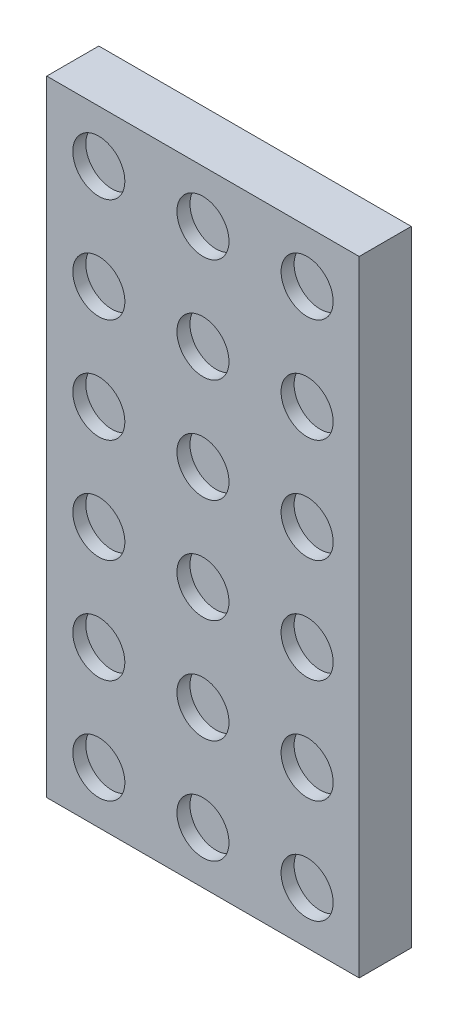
ISO-10303-21;
HEADER;
FILE_DESCRIPTION(('STEP AP214'),'2;1');
FILE_NAME('part.step','',(''),(''),'','','');
FILE_SCHEMA(('AUTOMOTIVE_DESIGN { 1 0 10303 214 1 1 1 1 }'));
ENDSEC;
DATA;
#1=APPLICATION_CONTEXT('core data for automotive mechanical design processes');
#2=APPLICATION_PROTOCOL_DEFINITION('international standard','automotive_design',2000,#1);
#3=PRODUCT_CONTEXT('',#1,'mechanical');
#4=PRODUCT('Part','Part','',(#3));
#5=PRODUCT_RELATED_PRODUCT_CATEGORY('part','',(#4));
#6=PRODUCT_DEFINITION_FORMATION('','',#4);
#7=PRODUCT_DEFINITION_CONTEXT('part definition',#1,'design');
#8=PRODUCT_DEFINITION('design','',#6,#7);
#9=PRODUCT_DEFINITION_SHAPE('','',#8);
#10=(LENGTH_UNIT() NAMED_UNIT(*) SI_UNIT(.MILLI.,.METRE.));
#11=(NAMED_UNIT(*) PLANE_ANGLE_UNIT() SI_UNIT($,.RADIAN.));
#12=(NAMED_UNIT(*) SI_UNIT($,.STERADIAN.) SOLID_ANGLE_UNIT());
#13=UNCERTAINTY_MEASURE_WITH_UNIT(LENGTH_MEASURE(1.E-05),#10,'distance_accuracy_value','');
#14=(GEOMETRIC_REPRESENTATION_CONTEXT(3) GLOBAL_UNCERTAINTY_ASSIGNED_CONTEXT((#13)) GLOBAL_UNIT_ASSIGNED_CONTEXT((#10,
#11,#12)) REPRESENTATION_CONTEXT('',''));
#15=CARTESIAN_POINT('',(0.,0.,0.));
#16=DIRECTION('',(0.,0.,1.));
#17=DIRECTION('',(1.,0.,0.));
#18=AXIS2_PLACEMENT_3D('',#15,#16,#17);
#19=CARTESIAN_POINT('',(0.,0.,12.7));
#20=DIRECTION('',(0.,0.,-1.));
#21=DIRECTION('',(-1.,0.,0.));
#22=AXIS2_PLACEMENT_3D('',#19,#20,#21);
#23=PLANE('',#22);
#24=CARTESIAN_POINT('',(63.5,88.9,12.7));
#25=DIRECTION('',(0.,0.,1.));
#26=DIRECTION('',(1.,0.,0.));
#27=AXIS2_PLACEMENT_3D('',#24,#25,#26);
#28=CIRCLE('',#27,6.34999999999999);
#29=CARTESIAN_POINT('',(69.85,88.9,12.7));
#30=VERTEX_POINT('',#29);
#31=EDGE_CURVE('E239',#30,#30,#28,.T.);
#32=ORIENTED_EDGE('',*,*,#31,.F.);
#33=EDGE_LOOP('',(#32));
#34=FACE_BOUND('',#33,.T.);
#35=CARTESIAN_POINT('',(38.1,88.9,12.7));
#36=DIRECTION('',(0.,0.,1.));
#37=DIRECTION('',(1.,0.,0.));
#38=AXIS2_PLACEMENT_3D('',#35,#36,#37);
#39=CIRCLE('',#38,6.35);
#40=CARTESIAN_POINT('',(44.45,88.9,12.7));
#41=VERTEX_POINT('',#40);
#42=EDGE_CURVE('E230',#41,#41,#39,.T.);
#43=ORIENTED_EDGE('',*,*,#42,.F.);
#44=EDGE_LOOP('',(#43));
#45=FACE_BOUND('',#44,.T.);
#46=CARTESIAN_POINT('',(12.7,38.1,12.7));
#47=DIRECTION('',(0.,0.,1.));
#48=DIRECTION('',(1.,0.,0.));
#49=AXIS2_PLACEMENT_3D('',#46,#47,#48);
#50=CIRCLE('',#49,6.35);
#51=CARTESIAN_POINT('',(19.05,38.1,12.7));
#52=VERTEX_POINT('',#51);
#53=EDGE_CURVE('E198',#52,#52,#50,.T.);
#54=ORIENTED_EDGE('',*,*,#53,.F.);
#55=EDGE_LOOP('',(#54));
#56=FACE_BOUND('',#55,.T.);
#57=CARTESIAN_POINT('',(38.1,139.7,12.7));
#58=DIRECTION('',(0.,0.,1.));
#59=DIRECTION('',(1.,0.,0.));
#60=AXIS2_PLACEMENT_3D('',#57,#58,#59);
#61=CIRCLE('',#60,6.35);
#62=CARTESIAN_POINT('',(44.45,139.7,12.7));
#63=VERTEX_POINT('',#62);
#64=EDGE_CURVE('E278',#63,#63,#61,.T.);
#65=ORIENTED_EDGE('',*,*,#64,.F.);
#66=EDGE_LOOP('',(#65));
#67=FACE_BOUND('',#66,.T.);
#68=CARTESIAN_POINT('',(63.5,139.7,12.7));
#69=DIRECTION('',(0.,0.,1.));
#70=DIRECTION('',(1.,0.,0.));
#71=AXIS2_PLACEMENT_3D('',#68,#69,#70);
#72=CIRCLE('',#71,6.34999999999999);
#73=CARTESIAN_POINT('',(69.85,139.7,12.7));
#74=VERTEX_POINT('',#73);
#75=EDGE_CURVE('E287',#74,#74,#72,.T.);
#76=ORIENTED_EDGE('',*,*,#75,.F.);
#77=EDGE_LOOP('',(#76));
#78=FACE_BOUND('',#77,.T.);
#79=CARTESIAN_POINT('',(12.7,88.9,12.7));
#80=DIRECTION('',(0.,0.,1.));
#81=DIRECTION('',(1.,0.,0.));
#82=AXIS2_PLACEMENT_3D('',#79,#80,#81);
#83=CIRCLE('',#82,6.35);
#84=CARTESIAN_POINT('',(19.05,88.9,12.7));
#85=VERTEX_POINT('',#84);
#86=EDGE_CURVE('E271',#85,#85,#83,.T.);
#87=ORIENTED_EDGE('',*,*,#86,.F.);
#88=EDGE_LOOP('',(#87));
#89=FACE_BOUND('',#88,.T.);
#90=CARTESIAN_POINT('',(38.1,38.1,12.7));
#91=DIRECTION('',(0.,0.,1.));
#92=DIRECTION('',(1.,0.,0.));
#93=AXIS2_PLACEMENT_3D('',#90,#91,#92);
#94=CIRCLE('',#93,6.35);
#95=CARTESIAN_POINT('',(44.45,38.1,12.7));
#96=VERTEX_POINT('',#95);
#97=EDGE_CURVE('E182',#96,#96,#94,.T.);
#98=ORIENTED_EDGE('',*,*,#97,.F.);
#99=EDGE_LOOP('',(#98));
#100=FACE_BOUND('',#99,.T.);
#101=CARTESIAN_POINT('',(63.5,38.1,12.7));
#102=DIRECTION('',(0.,0.,1.));
#103=DIRECTION('',(1.,0.,0.));
#104=AXIS2_PLACEMENT_3D('',#101,#102,#103);
#105=CIRCLE('',#104,6.35);
#106=CARTESIAN_POINT('',(69.85,38.1,12.7));
#107=VERTEX_POINT('',#106);
#108=EDGE_CURVE('E191',#107,#107,#105,.T.);
#109=ORIENTED_EDGE('',*,*,#108,.F.);
#110=EDGE_LOOP('',(#109));
#111=FACE_BOUND('',#110,.T.);
#112=CARTESIAN_POINT('',(12.7,139.7,12.7));
#113=DIRECTION('',(0.,0.,1.));
#114=DIRECTION('',(1.,0.,0.));
#115=AXIS2_PLACEMENT_3D('',#112,#113,#114);
#116=CIRCLE('',#115,6.35);
#117=CARTESIAN_POINT('',(19.05,139.7,12.7));
#118=VERTEX_POINT('',#117);
#119=EDGE_CURVE('E282',#118,#118,#116,.T.);
#120=ORIENTED_EDGE('',*,*,#119,.F.);
#121=EDGE_LOOP('',(#120));
#122=FACE_BOUND('',#121,.T.);
#123=DIRECTION('',(0.,-1.,0.));
#124=VECTOR('',#123,1.);
#125=CARTESIAN_POINT('',(0.,0.,12.7));
#126=LINE('',#125,#124);
#127=CARTESIAN_POINT('',(0.,152.4,12.7));
#128=VERTEX_POINT('',#127);
#129=CARTESIAN_POINT('',(0.,0.,12.7));
#130=VERTEX_POINT('',#129);
#131=EDGE_CURVE('E302',#128,#130,#126,.T.);
#132=ORIENTED_EDGE('',*,*,#131,.T.);
#133=DIRECTION('',(1.,0.,0.));
#134=VECTOR('',#133,1.);
#135=CARTESIAN_POINT('',(0.,0.,12.7));
#136=LINE('',#135,#134);
#137=CARTESIAN_POINT('',(76.2,0.,12.7));
#138=VERTEX_POINT('',#137);
#139=EDGE_CURVE('E98',#130,#138,#136,.T.);
#140=ORIENTED_EDGE('',*,*,#139,.T.);
#141=DIRECTION('',(0.,1.,0.));
#142=VECTOR('',#141,1.);
#143=CARTESIAN_POINT('',(76.2,0.,12.7));
#144=LINE('',#143,#142);
#145=CARTESIAN_POINT('',(76.2,152.4,12.7));
#146=VERTEX_POINT('',#145);
#147=EDGE_CURVE('E307',#138,#146,#144,.T.);
#148=ORIENTED_EDGE('',*,*,#147,.T.);
#149=DIRECTION('',(-1.,0.,0.));
#150=VECTOR('',#149,1.);
#151=CARTESIAN_POINT('',(0.,152.4,12.7));
#152=LINE('',#151,#150);
#153=EDGE_CURVE('E70',#146,#128,#152,.T.);
#154=ORIENTED_EDGE('',*,*,#153,.T.);
#155=EDGE_LOOP('',(#132,#140,#148,#154));
#156=FACE_BOUND('',#155,.T.);
#157=CARTESIAN_POINT('',(12.7,12.7,12.7));
#158=DIRECTION('',(0.,0.,-1.));
#159=DIRECTION('',(-1.,0.,0.));
#160=AXIS2_PLACEMENT_3D('',#157,#158,#159);
#161=CIRCLE('',#160,6.35);
#162=CARTESIAN_POINT('',(6.35,12.7,12.7));
#163=VERTEX_POINT('',#162);
#164=EDGE_CURVE('E174',#163,#163,#161,.T.);
#165=ORIENTED_EDGE('',*,*,#164,.T.);
#166=EDGE_LOOP('',(#165));
#167=FACE_BOUND('',#166,.T.);
#168=CARTESIAN_POINT('',(38.1,12.7,12.7));
#169=DIRECTION('',(0.,0.,-1.));
#170=DIRECTION('',(-1.,0.,0.));
#171=AXIS2_PLACEMENT_3D('',#168,#169,#170);
#172=CIRCLE('',#171,6.35);
#173=CARTESIAN_POINT('',(31.75,12.7,12.7));
#174=VERTEX_POINT('',#173);
#175=EDGE_CURVE('E158',#174,#174,#172,.T.);
#176=ORIENTED_EDGE('',*,*,#175,.T.);
#177=EDGE_LOOP('',(#176));
#178=FACE_BOUND('',#177,.T.);
#179=CARTESIAN_POINT('',(63.5,12.7,12.7));
#180=DIRECTION('',(0.,0.,-1.));
#181=DIRECTION('',(-1.,0.,0.));
#182=AXIS2_PLACEMENT_3D('',#179,#180,#181);
#183=CIRCLE('',#182,6.35);
#184=CARTESIAN_POINT('',(57.15,12.7,12.7));
#185=VERTEX_POINT('',#184);
#186=EDGE_CURVE('E167',#185,#185,#183,.T.);
#187=ORIENTED_EDGE('',*,*,#186,.T.);
#188=EDGE_LOOP('',(#187));
#189=FACE_BOUND('',#188,.T.);
#190=CARTESIAN_POINT('',(12.7,114.3,12.7));
#191=DIRECTION('',(0.,0.,-1.));
#192=DIRECTION('',(-1.,0.,0.));
#193=AXIS2_PLACEMENT_3D('',#190,#191,#192);
#194=CIRCLE('',#193,6.35);
#195=CARTESIAN_POINT('',(6.35,114.3,12.7));
#196=VERTEX_POINT('',#195);
#197=EDGE_CURVE('E263',#196,#196,#194,.T.);
#198=ORIENTED_EDGE('',*,*,#197,.T.);
#199=EDGE_LOOP('',(#198));
#200=FACE_BOUND('',#199,.T.);
#201=CARTESIAN_POINT('',(38.1,114.3,12.7));
#202=DIRECTION('',(0.,0.,-1.));
#203=DIRECTION('',(-1.,0.,0.));
#204=AXIS2_PLACEMENT_3D('',#201,#202,#203);
#205=CIRCLE('',#204,6.35);
#206=CARTESIAN_POINT('',(31.75,114.3,12.7));
#207=VERTEX_POINT('',#206);
#208=EDGE_CURVE('E255',#207,#207,#205,.T.);
#209=ORIENTED_EDGE('',*,*,#208,.T.);
#210=EDGE_LOOP('',(#209));
#211=FACE_BOUND('',#210,.T.);
#212=CARTESIAN_POINT('',(63.5,114.3,12.7));
#213=DIRECTION('',(0.,0.,-1.));
#214=DIRECTION('',(-1.,0.,0.));
#215=AXIS2_PLACEMENT_3D('',#212,#213,#214);
#216=CIRCLE('',#215,6.34999999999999);
#217=CARTESIAN_POINT('',(57.15,114.3,12.7));
#218=VERTEX_POINT('',#217);
#219=EDGE_CURVE('E246',#218,#218,#216,.T.);
#220=ORIENTED_EDGE('',*,*,#219,.T.);
#221=EDGE_LOOP('',(#220));
#222=FACE_BOUND('',#221,.T.);
#223=CARTESIAN_POINT('',(38.1,63.5,12.7));
#224=DIRECTION('',(0.,0.,-1.));
#225=DIRECTION('',(-1.,0.,0.));
#226=AXIS2_PLACEMENT_3D('',#223,#224,#225);
#227=CIRCLE('',#226,6.35);
#228=CARTESIAN_POINT('',(31.75,63.5,12.7));
#229=VERTEX_POINT('',#228);
#230=EDGE_CURVE('E206',#229,#229,#227,.T.);
#231=ORIENTED_EDGE('',*,*,#230,.T.);
#232=EDGE_LOOP('',(#231));
#233=FACE_BOUND('',#232,.T.);
#234=CARTESIAN_POINT('',(63.5,63.5,12.7));
#235=DIRECTION('',(0.,0.,-1.));
#236=DIRECTION('',(-1.,0.,0.));
#237=AXIS2_PLACEMENT_3D('',#234,#235,#236);
#238=CIRCLE('',#237,6.34999999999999);
#239=CARTESIAN_POINT('',(57.15,63.5,12.7));
#240=VERTEX_POINT('',#239);
#241=EDGE_CURVE('E215',#240,#240,#238,.T.);
#242=ORIENTED_EDGE('',*,*,#241,.T.);
#243=EDGE_LOOP('',(#242));
#244=FACE_BOUND('',#243,.T.);
#245=CARTESIAN_POINT('',(12.7,63.5,12.7));
#246=DIRECTION('',(0.,0.,-1.));
#247=DIRECTION('',(-1.,0.,0.));
#248=AXIS2_PLACEMENT_3D('',#245,#246,#247);
#249=CIRCLE('',#248,6.35);
#250=CARTESIAN_POINT('',(6.35,63.5,12.7));
#251=VERTEX_POINT('',#250);
#252=EDGE_CURVE('E222',#251,#251,#249,.T.);
#253=ORIENTED_EDGE('',*,*,#252,.T.);
#254=EDGE_LOOP('',(#253));
#255=FACE_BOUND('',#254,.T.);
#256=ADVANCED_FACE('F45',(#34,#45,#56,#67,#78,#89,#100,#111,#122,#156,#167,#178,#189,#200,#211,
#222,#233,#244,#255),#23,.F.);
#257=CARTESIAN_POINT('',(0.,0.,12.7));
#258=DIRECTION('',(1.,0.,0.));
#259=DIRECTION('',(0.,0.,-1.));
#260=AXIS2_PLACEMENT_3D('',#257,#258,#259);
#261=PLANE('',#260);
#262=DIRECTION('',(0.,-1.,0.));
#263=VECTOR('',#262,1.);
#264=CARTESIAN_POINT('',(0.,0.,0.));
#265=LINE('',#264,#263);
#266=CARTESIAN_POINT('',(0.,152.4,0.));
#267=VERTEX_POINT('',#266);
#268=CARTESIAN_POINT('',(0.,0.,0.));
#269=VERTEX_POINT('',#268);
#270=EDGE_CURVE('E298',#267,#269,#265,.T.);
#271=ORIENTED_EDGE('',*,*,#270,.T.);
#272=DIRECTION('',(0.,0.,-1.));
#273=VECTOR('',#272,1.);
#274=CARTESIAN_POINT('',(0.,0.,12.7));
#275=LINE('',#274,#273);
#276=EDGE_CURVE('E11',#130,#269,#275,.T.);
#277=ORIENTED_EDGE('',*,*,#276,.F.);
#278=ORIENTED_EDGE('',*,*,#131,.F.);
#279=DIRECTION('',(0.,0.,-1.));
#280=VECTOR('',#279,1.);
#281=CARTESIAN_POINT('',(0.,152.4,12.7));
#282=LINE('',#281,#280);
#283=EDGE_CURVE('E312',#128,#267,#282,.T.);
#284=ORIENTED_EDGE('',*,*,#283,.T.);
#285=EDGE_LOOP('',(#271,#277,#278,#284));
#286=FACE_BOUND('',#285,.T.);
#287=ADVANCED_FACE('F47',(#286),#261,.F.);
#288=CARTESIAN_POINT('',(0.,0.,12.7));
#289=DIRECTION('',(0.,1.,0.));
#290=DIRECTION('',(0.,0.,1.));
#291=AXIS2_PLACEMENT_3D('',#288,#289,#290);
#292=PLANE('',#291);
#293=DIRECTION('',(-1.,0.,0.));
#294=VECTOR('',#293,1.);
#295=CARTESIAN_POINT('',(36.83,0.,8.89));
#296=LINE('',#295,#294);
#297=CARTESIAN_POINT('',(39.37,0.,8.89));
#298=VERTEX_POINT('',#297);
#299=CARTESIAN_POINT('',(36.83,0.,8.89));
#300=VERTEX_POINT('',#299);
#301=EDGE_CURVE('E128',#298,#300,#296,.T.);
#302=ORIENTED_EDGE('',*,*,#301,.F.);
#303=DIRECTION('',(0.,0.,-1.));
#304=VECTOR('',#303,1.);
#305=CARTESIAN_POINT('',(39.37,0.,8.89));
#306=LINE('',#305,#304);
#307=CARTESIAN_POINT('',(39.37,0.,0.));
#308=VERTEX_POINT('',#307);
#309=EDGE_CURVE('E157',#298,#308,#306,.T.);
#310=ORIENTED_EDGE('',*,*,#309,.T.);
#311=DIRECTION('',(1.,0.,0.));
#312=VECTOR('',#311,1.);
#313=CARTESIAN_POINT('',(0.,0.,0.));
#314=LINE('',#313,#312);
#315=CARTESIAN_POINT('',(76.2,0.,0.));
#316=VERTEX_POINT('',#315);
#317=EDGE_CURVE('E316',#308,#316,#314,.T.);
#318=ORIENTED_EDGE('',*,*,#317,.T.);
#319=DIRECTION('',(0.,0.,-1.));
#320=VECTOR('',#319,1.);
#321=CARTESIAN_POINT('',(76.2,0.,12.7));
#322=LINE('',#321,#320);
#323=EDGE_CURVE('E54',#138,#316,#322,.T.);
#324=ORIENTED_EDGE('',*,*,#323,.F.);
#325=ORIENTED_EDGE('',*,*,#139,.F.);
#326=ORIENTED_EDGE('',*,*,#276,.T.);
#327=CARTESIAN_POINT('',(36.83,0.,0.));
#328=VERTEX_POINT('',#327);
#329=EDGE_CURVE('E139',#269,#328,#314,.T.);
#330=ORIENTED_EDGE('',*,*,#329,.T.);
#331=DIRECTION('',(0.,0.,-1.));
#332=VECTOR('',#331,1.);
#333=CARTESIAN_POINT('',(36.83,0.,8.89));
#334=LINE('',#333,#332);
#335=EDGE_CURVE('E121',#300,#328,#334,.T.);
#336=ORIENTED_EDGE('',*,*,#335,.F.);
#337=EDGE_LOOP('',(#302,#310,#318,#324,#325,#326,#330,#336));
#338=FACE_BOUND('',#337,.T.);
#339=ADVANCED_FACE('F138',(#338),#292,.F.);
#340=CARTESIAN_POINT('',(76.2,0.,12.7));
#341=DIRECTION('',(-1.,0.,0.));
#342=DIRECTION('',(0.,0.,1.));
#343=AXIS2_PLACEMENT_3D('',#340,#341,#342);
#344=PLANE('',#343);
#345=DIRECTION('',(0.,1.,0.));
#346=VECTOR('',#345,1.);
#347=CARTESIAN_POINT('',(76.2,0.,0.));
#348=LINE('',#347,#346);
#349=CARTESIAN_POINT('',(76.2,152.4,0.));
#350=VERTEX_POINT('',#349);
#351=EDGE_CURVE('E319',#316,#350,#348,.T.);
#352=ORIENTED_EDGE('',*,*,#351,.T.);
#353=DIRECTION('',(0.,0.,-1.));
#354=VECTOR('',#353,1.);
#355=CARTESIAN_POINT('',(76.2,152.4,12.7));
#356=LINE('',#355,#354);
#357=EDGE_CURVE('E326',#146,#350,#356,.T.);
#358=ORIENTED_EDGE('',*,*,#357,.F.);
#359=ORIENTED_EDGE('',*,*,#147,.F.);
#360=ORIENTED_EDGE('',*,*,#323,.T.);
#361=EDGE_LOOP('',(#352,#358,#359,#360));
#362=FACE_BOUND('',#361,.T.);
#363=ADVANCED_FACE('F333',(#362),#344,.F.);
#364=CARTESIAN_POINT('',(0.,152.4,12.7));
#365=DIRECTION('',(0.,-1.,0.));
#366=DIRECTION('',(0.,0.,-1.));
#367=AXIS2_PLACEMENT_3D('',#364,#365,#366);
#368=PLANE('',#367);
#369=DIRECTION('',(-1.,0.,0.));
#370=VECTOR('',#369,1.);
#371=CARTESIAN_POINT('',(0.,152.4,0.));
#372=LINE('',#371,#370);
#373=EDGE_CURVE('E91',#350,#267,#372,.T.);
#374=ORIENTED_EDGE('',*,*,#373,.T.);
#375=ORIENTED_EDGE('',*,*,#283,.F.);
#376=ORIENTED_EDGE('',*,*,#153,.F.);
#377=ORIENTED_EDGE('',*,*,#357,.T.);
#378=EDGE_LOOP('',(#374,#375,#376,#377));
#379=FACE_BOUND('',#378,.T.);
#380=ADVANCED_FACE('F343',(#379),#368,.F.);
#381=CARTESIAN_POINT('',(0.,0.,0.));
#382=DIRECTION('',(0.,0.,-1.));
#383=DIRECTION('',(-1.,0.,0.));
#384=AXIS2_PLACEMENT_3D('',#381,#382,#383);
#385=PLANE('',#384);
#386=DIRECTION('',(0.,-1.,0.));
#387=VECTOR('',#386,1.);
#388=CARTESIAN_POINT('',(39.37,0.,0.));
#389=LINE('',#388,#387);
#390=CARTESIAN_POINT('',(39.37,44.4754101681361,0.));
#391=VERTEX_POINT('',#390);
#392=EDGE_CURVE('E135',#391,#308,#389,.T.);
#393=ORIENTED_EDGE('',*,*,#392,.F.);
#394=CARTESIAN_POINT('',(38.1,76.2,0.));
#395=DIRECTION('',(0.,0.,-1.));
#396=DIRECTION('',(-1.,0.,0.));
#397=AXIS2_PLACEMENT_3D('',#394,#395,#396);
#398=CIRCLE('',#397,31.75);
#399=CARTESIAN_POINT('',(36.83,44.4754101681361,0.));
#400=VERTEX_POINT('',#399);
#401=EDGE_CURVE('E153',#400,#391,#398,.T.);
#402=ORIENTED_EDGE('',*,*,#401,.F.);
#403=DIRECTION('',(0.,1.,0.));
#404=VECTOR('',#403,1.);
#405=CARTESIAN_POINT('',(36.83,0.,0.));
#406=LINE('',#405,#404);
#407=EDGE_CURVE('E521',#328,#400,#406,.T.);
#408=ORIENTED_EDGE('',*,*,#407,.F.);
#409=ORIENTED_EDGE('',*,*,#329,.F.);
#410=ORIENTED_EDGE('',*,*,#270,.F.);
#411=ORIENTED_EDGE('',*,*,#373,.F.);
#412=ORIENTED_EDGE('',*,*,#351,.F.);
#413=ORIENTED_EDGE('',*,*,#317,.F.);
#414=EDGE_LOOP('',(#393,#402,#408,#409,#410,#411,#412,#413));
#415=FACE_BOUND('',#414,.T.);
#416=ADVANCED_FACE('F338',(#415),#385,.T.);
#417=CARTESIAN_POINT('',(12.7,139.7,9.525));
#418=DIRECTION('',(0.,0.,1.));
#419=DIRECTION('',(1.,0.,0.));
#420=AXIS2_PLACEMENT_3D('',#417,#418,#419);
#421=CYLINDRICAL_SURFACE('',#420,6.35);
#422=CARTESIAN_POINT('',(12.7,139.7,9.525));
#423=DIRECTION('',(0.,0.,1.));
#424=DIRECTION('',(1.,0.,0.));
#425=AXIS2_PLACEMENT_3D('',#422,#423,#424);
#426=CIRCLE('',#425,6.35);
#427=CARTESIAN_POINT('',(19.05,139.7,9.525));
#428=VERTEX_POINT('',#427);
#429=EDGE_CURVE('E294',#428,#428,#426,.T.);
#430=ORIENTED_EDGE('',*,*,#429,.F.);
#431=EDGE_LOOP('',(#430));
#432=FACE_BOUND('',#431,.T.);
#433=ORIENTED_EDGE('',*,*,#119,.T.);
#434=EDGE_LOOP('',(#433));
#435=FACE_BOUND('',#434,.T.);
#436=ADVANCED_FACE('F351',(#432,#435),#421,.F.);
#437=CARTESIAN_POINT('',(12.7,139.7,9.525));
#438=DIRECTION('',(0.,0.,1.));
#439=DIRECTION('',(1.,0.,0.));
#440=AXIS2_PLACEMENT_3D('',#437,#438,#439);
#441=PLANE('',#440);
#442=ORIENTED_EDGE('',*,*,#429,.T.);
#443=EDGE_LOOP('',(#442));
#444=FACE_BOUND('',#443,.T.);
#445=ADVANCED_FACE('F364',(#444),#441,.T.);
#446=CARTESIAN_POINT('',(12.7,12.7,9.525));
#447=DIRECTION('',(0.,0.,1.));
#448=DIRECTION('',(1.,0.,0.));
#449=AXIS2_PLACEMENT_3D('',#446,#447,#448);
#450=CYLINDRICAL_SURFACE('',#449,6.35);
#451=CARTESIAN_POINT('',(12.7,12.7,9.525));
#452=DIRECTION('',(0.,0.,-1.));
#453=DIRECTION('',(-1.,0.,0.));
#454=AXIS2_PLACEMENT_3D('',#451,#452,#453);
#455=CIRCLE('',#454,6.35);
#456=CARTESIAN_POINT('',(6.35,12.7,9.525));
#457=VERTEX_POINT('',#456);
#458=EDGE_CURVE('E162',#457,#457,#455,.T.);
#459=ORIENTED_EDGE('',*,*,#458,.T.);
#460=EDGE_LOOP('',(#459));
#461=FACE_BOUND('',#460,.T.);
#462=ORIENTED_EDGE('',*,*,#164,.F.);
#463=EDGE_LOOP('',(#462));
#464=FACE_BOUND('',#463,.T.);
#465=ADVANCED_FACE('F368',(#461,#464),#450,.F.);
#466=CARTESIAN_POINT('',(12.7,12.7,9.525));
#467=DIRECTION('',(0.,0.,-1.));
#468=DIRECTION('',(-1.,0.,0.));
#469=AXIS2_PLACEMENT_3D('',#466,#467,#468);
#470=PLANE('',#469);
#471=ORIENTED_EDGE('',*,*,#458,.F.);
#472=EDGE_LOOP('',(#471));
#473=FACE_BOUND('',#472,.T.);
#474=ADVANCED_FACE('F476',(#473),#470,.F.);
#475=CARTESIAN_POINT('',(63.5,38.1,9.525));
#476=DIRECTION('',(0.,0.,1.));
#477=DIRECTION('',(1.,0.,0.));
#478=AXIS2_PLACEMENT_3D('',#475,#476,#477);
#479=CYLINDRICAL_SURFACE('',#478,6.35);
#480=CARTESIAN_POINT('',(63.5,38.1,9.525));
#481=DIRECTION('',(0.,0.,1.));
#482=DIRECTION('',(1.,0.,0.));
#483=AXIS2_PLACEMENT_3D('',#480,#481,#482);
#484=CIRCLE('',#483,6.35);
#485=CARTESIAN_POINT('',(69.85,38.1,9.525));
#486=VERTEX_POINT('',#485);
#487=EDGE_CURVE('E178',#486,#486,#484,.T.);
#488=ORIENTED_EDGE('',*,*,#487,.F.);
#489=EDGE_LOOP('',(#488));
#490=FACE_BOUND('',#489,.T.);
#491=ORIENTED_EDGE('',*,*,#108,.T.);
#492=EDGE_LOOP('',(#491));
#493=FACE_BOUND('',#492,.T.);
#494=ADVANCED_FACE('F472',(#490,#493),#479,.F.);
#495=CARTESIAN_POINT('',(63.5,38.1,9.525));
#496=DIRECTION('',(0.,0.,1.));
#497=DIRECTION('',(1.,0.,0.));
#498=AXIS2_PLACEMENT_3D('',#495,#496,#497);
#499=PLANE('',#498);
#500=ORIENTED_EDGE('',*,*,#487,.T.);
#501=EDGE_LOOP('',(#500));
#502=FACE_BOUND('',#501,.T.);
#503=ADVANCED_FACE('F468',(#502),#499,.T.);
#504=CARTESIAN_POINT('',(38.1,38.1,9.525));
#505=DIRECTION('',(0.,0.,1.));
#506=DIRECTION('',(1.,0.,0.));
#507=AXIS2_PLACEMENT_3D('',#504,#505,#506);
#508=CYLINDRICAL_SURFACE('',#507,6.35);
#509=CARTESIAN_POINT('',(38.1,38.1,9.525));
#510=DIRECTION('',(0.,0.,1.));
#511=DIRECTION('',(1.,0.,0.));
#512=AXIS2_PLACEMENT_3D('',#509,#510,#511);
#513=CIRCLE('',#512,6.35);
#514=CARTESIAN_POINT('',(44.45,38.1,9.525));
#515=VERTEX_POINT('',#514);
#516=EDGE_CURVE('E187',#515,#515,#513,.T.);
#517=ORIENTED_EDGE('',*,*,#516,.F.);
#518=EDGE_LOOP('',(#517));
#519=FACE_BOUND('',#518,.T.);
#520=ORIENTED_EDGE('',*,*,#97,.T.);
#521=EDGE_LOOP('',(#520));
#522=FACE_BOUND('',#521,.T.);
#523=ADVANCED_FACE('F471',(#519,#522),#508,.F.);
#524=CARTESIAN_POINT('',(38.1,38.1,9.525));
#525=DIRECTION('',(0.,0.,1.));
#526=DIRECTION('',(1.,0.,0.));
#527=AXIS2_PLACEMENT_3D('',#524,#525,#526);
#528=PLANE('',#527);
#529=ORIENTED_EDGE('',*,*,#516,.T.);
#530=EDGE_LOOP('',(#529));
#531=FACE_BOUND('',#530,.T.);
#532=ADVANCED_FACE('F478',(#531),#528,.T.);
#533=CARTESIAN_POINT('',(38.1,12.7,9.525));
#534=DIRECTION('',(0.,0.,1.));
#535=DIRECTION('',(1.,0.,0.));
#536=AXIS2_PLACEMENT_3D('',#533,#534,#535);
#537=CYLINDRICAL_SURFACE('',#536,6.35);
#538=CARTESIAN_POINT('',(38.1,12.7,9.525));
#539=DIRECTION('',(0.,0.,-1.));
#540=DIRECTION('',(-1.,0.,0.));
#541=AXIS2_PLACEMENT_3D('',#538,#539,#540);
#542=CIRCLE('',#541,6.35);
#543=CARTESIAN_POINT('',(31.75,12.7,9.525));
#544=VERTEX_POINT('',#543);
#545=EDGE_CURVE('E163',#544,#544,#542,.T.);
#546=ORIENTED_EDGE('',*,*,#545,.T.);
#547=EDGE_LOOP('',(#546));
#548=FACE_BOUND('',#547,.T.);
#549=ORIENTED_EDGE('',*,*,#175,.F.);
#550=EDGE_LOOP('',(#549));
#551=FACE_BOUND('',#550,.T.);
#552=ADVANCED_FACE('F481',(#548,#551),#537,.F.);
#553=CARTESIAN_POINT('',(38.1,12.7,9.525));
#554=DIRECTION('',(0.,0.,-1.));
#555=DIRECTION('',(-1.,0.,0.));
#556=AXIS2_PLACEMENT_3D('',#553,#554,#555);
#557=PLANE('',#556);
#558=ORIENTED_EDGE('',*,*,#545,.F.);
#559=EDGE_LOOP('',(#558));
#560=FACE_BOUND('',#559,.T.);
#561=ADVANCED_FACE('F498',(#560),#557,.F.);
#562=CARTESIAN_POINT('',(63.5,12.7,9.525));
#563=DIRECTION('',(0.,0.,1.));
#564=DIRECTION('',(1.,0.,0.));
#565=AXIS2_PLACEMENT_3D('',#562,#563,#564);
#566=CYLINDRICAL_SURFACE('',#565,6.35);
#567=CARTESIAN_POINT('',(63.5,12.7,9.525));
#568=DIRECTION('',(0.,0.,-1.));
#569=DIRECTION('',(-1.,0.,0.));
#570=AXIS2_PLACEMENT_3D('',#567,#568,#569);
#571=CIRCLE('',#570,6.35);
#572=CARTESIAN_POINT('',(57.15,12.7,9.525));
#573=VERTEX_POINT('',#572);
#574=EDGE_CURVE('E152',#573,#573,#571,.T.);
#575=ORIENTED_EDGE('',*,*,#574,.T.);
#576=EDGE_LOOP('',(#575));
#577=FACE_BOUND('',#576,.T.);
#578=ORIENTED_EDGE('',*,*,#186,.F.);
#579=EDGE_LOOP('',(#578));
#580=FACE_BOUND('',#579,.T.);
#581=ADVANCED_FACE('F494',(#577,#580),#566,.F.);
#582=CARTESIAN_POINT('',(63.5,12.7,9.525));
#583=DIRECTION('',(0.,0.,-1.));
#584=DIRECTION('',(-1.,0.,0.));
#585=AXIS2_PLACEMENT_3D('',#582,#583,#584);
#586=PLANE('',#585);
#587=ORIENTED_EDGE('',*,*,#574,.F.);
#588=EDGE_LOOP('',(#587));
#589=FACE_BOUND('',#588,.T.);
#590=ADVANCED_FACE('F396',(#589),#586,.F.);
#591=CARTESIAN_POINT('',(12.7,88.9,9.525));
#592=DIRECTION('',(0.,0.,1.));
#593=DIRECTION('',(1.,0.,0.));
#594=AXIS2_PLACEMENT_3D('',#591,#592,#593);
#595=CYLINDRICAL_SURFACE('',#594,6.35);
#596=CARTESIAN_POINT('',(12.7,88.9,9.525));
#597=DIRECTION('',(0.,0.,1.));
#598=DIRECTION('',(1.,0.,0.));
#599=AXIS2_PLACEMENT_3D('',#596,#597,#598);
#600=CIRCLE('',#599,6.35);
#601=CARTESIAN_POINT('',(19.05,88.9,9.525));
#602=VERTEX_POINT('',#601);
#603=EDGE_CURVE('E234',#602,#602,#600,.T.);
#604=ORIENTED_EDGE('',*,*,#603,.F.);
#605=EDGE_LOOP('',(#604));
#606=FACE_BOUND('',#605,.T.);
#607=ORIENTED_EDGE('',*,*,#86,.T.);
#608=EDGE_LOOP('',(#607));
#609=FACE_BOUND('',#608,.T.);
#610=ADVANCED_FACE('F392',(#606,#609),#595,.F.);
#611=CARTESIAN_POINT('',(12.7,88.9,9.525));
#612=DIRECTION('',(0.,0.,1.));
#613=DIRECTION('',(1.,0.,0.));
#614=AXIS2_PLACEMENT_3D('',#611,#612,#613);
#615=PLANE('',#614);
#616=ORIENTED_EDGE('',*,*,#603,.T.);
#617=EDGE_LOOP('',(#616));
#618=FACE_BOUND('',#617,.T.);
#619=ADVANCED_FACE('F388',(#618),#615,.T.);
#620=CARTESIAN_POINT('',(12.7,114.3,9.525));
#621=DIRECTION('',(0.,0.,1.));
#622=DIRECTION('',(1.,0.,0.));
#623=AXIS2_PLACEMENT_3D('',#620,#621,#622);
#624=CYLINDRICAL_SURFACE('',#623,6.35);
#625=CARTESIAN_POINT('',(12.7,114.3,9.525));
#626=DIRECTION('',(0.,0.,-1.));
#627=DIRECTION('',(-1.,0.,0.));
#628=AXIS2_PLACEMENT_3D('',#625,#626,#627);
#629=CIRCLE('',#628,6.35);
#630=CARTESIAN_POINT('',(6.35,114.3,9.525));
#631=VERTEX_POINT('',#630);
#632=EDGE_CURVE('E267',#631,#631,#629,.T.);
#633=ORIENTED_EDGE('',*,*,#632,.T.);
#634=EDGE_LOOP('',(#633));
#635=FACE_BOUND('',#634,.T.);
#636=ORIENTED_EDGE('',*,*,#197,.F.);
#637=EDGE_LOOP('',(#636));
#638=FACE_BOUND('',#637,.T.);
#639=ADVANCED_FACE('F391',(#635,#638),#624,.F.);
#640=CARTESIAN_POINT('',(12.7,114.3,9.525));
#641=DIRECTION('',(0.,0.,-1.));
#642=DIRECTION('',(-1.,0.,0.));
#643=AXIS2_PLACEMENT_3D('',#640,#641,#642);
#644=PLANE('',#643);
#645=ORIENTED_EDGE('',*,*,#632,.F.);
#646=EDGE_LOOP('',(#645));
#647=FACE_BOUND('',#646,.T.);
#648=ADVANCED_FACE('F398',(#647),#644,.F.);
#649=CARTESIAN_POINT('',(38.1,114.3,9.525));
#650=DIRECTION('',(0.,0.,1.));
#651=DIRECTION('',(1.,0.,0.));
#652=AXIS2_PLACEMENT_3D('',#649,#650,#651);
#653=CYLINDRICAL_SURFACE('',#652,6.35);
#654=CARTESIAN_POINT('',(38.1,114.3,9.525));
#655=DIRECTION('',(0.,0.,-1.));
#656=DIRECTION('',(-1.,0.,0.));
#657=AXIS2_PLACEMENT_3D('',#654,#655,#656);
#658=CIRCLE('',#657,6.35);
#659=CARTESIAN_POINT('',(31.75,114.3,9.525));
#660=VERTEX_POINT('',#659);
#661=EDGE_CURVE('E259',#660,#660,#658,.T.);
#662=ORIENTED_EDGE('',*,*,#661,.T.);
#663=EDGE_LOOP('',(#662));
#664=FACE_BOUND('',#663,.T.);
#665=ORIENTED_EDGE('',*,*,#208,.F.);
#666=EDGE_LOOP('',(#665));
#667=FACE_BOUND('',#666,.T.);
#668=ADVANCED_FACE('F401',(#664,#667),#653,.F.);
#669=CARTESIAN_POINT('',(38.1,114.3,9.525));
#670=DIRECTION('',(0.,0.,-1.));
#671=DIRECTION('',(-1.,0.,0.));
#672=AXIS2_PLACEMENT_3D('',#669,#670,#671);
#673=PLANE('',#672);
#674=ORIENTED_EDGE('',*,*,#661,.F.);
#675=EDGE_LOOP('',(#674));
#676=FACE_BOUND('',#675,.T.);
#677=ADVANCED_FACE('F406',(#676),#673,.F.);
#678=CARTESIAN_POINT('',(63.5,114.3,9.525));
#679=DIRECTION('',(0.,0.,1.));
#680=DIRECTION('',(1.,0.,0.));
#681=AXIS2_PLACEMENT_3D('',#678,#679,#680);
#682=CYLINDRICAL_SURFACE('',#681,6.34999999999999);
#683=CARTESIAN_POINT('',(63.5,114.3,9.525));
#684=DIRECTION('',(0.,0.,-1.));
#685=DIRECTION('',(-1.,0.,0.));
#686=AXIS2_PLACEMENT_3D('',#683,#684,#685);
#687=CIRCLE('',#686,6.34999999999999);
#688=CARTESIAN_POINT('',(57.15,114.3,9.525));
#689=VERTEX_POINT('',#688);
#690=EDGE_CURVE('E251',#689,#689,#687,.T.);
#691=ORIENTED_EDGE('',*,*,#690,.T.);
#692=EDGE_LOOP('',(#691));
#693=FACE_BOUND('',#692,.T.);
#694=ORIENTED_EDGE('',*,*,#219,.F.);
#695=EDGE_LOOP('',(#694));
#696=FACE_BOUND('',#695,.T.);
#697=ADVANCED_FACE('F409',(#693,#696),#682,.F.);
#698=CARTESIAN_POINT('',(63.5,114.3,9.525));
#699=DIRECTION('',(0.,0.,-1.));
#700=DIRECTION('',(-1.,0.,0.));
#701=AXIS2_PLACEMENT_3D('',#698,#699,#700);
#702=PLANE('',#701);
#703=ORIENTED_EDGE('',*,*,#690,.F.);
#704=EDGE_LOOP('',(#703));
#705=FACE_BOUND('',#704,.T.);
#706=ADVANCED_FACE('F378',(#705),#702,.F.);
#707=CARTESIAN_POINT('',(63.5,139.7,9.525));
#708=DIRECTION('',(0.,0.,1.));
#709=DIRECTION('',(1.,0.,0.));
#710=AXIS2_PLACEMENT_3D('',#707,#708,#709);
#711=CYLINDRICAL_SURFACE('',#710,6.34999999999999);
#712=CARTESIAN_POINT('',(63.5,139.7,9.525));
#713=DIRECTION('',(0.,0.,1.));
#714=DIRECTION('',(1.,0.,0.));
#715=AXIS2_PLACEMENT_3D('',#712,#713,#714);
#716=CIRCLE('',#715,6.34999999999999);
#717=CARTESIAN_POINT('',(69.85,139.7,9.525));
#718=VERTEX_POINT('',#717);
#719=EDGE_CURVE('E250',#718,#718,#716,.T.);
#720=ORIENTED_EDGE('',*,*,#719,.F.);
#721=EDGE_LOOP('',(#720));
#722=FACE_BOUND('',#721,.T.);
#723=ORIENTED_EDGE('',*,*,#75,.T.);
#724=EDGE_LOOP('',(#723));
#725=FACE_BOUND('',#724,.T.);
#726=ADVANCED_FACE('F374',(#722,#725),#711,.F.);
#727=CARTESIAN_POINT('',(63.5,139.7,9.525));
#728=DIRECTION('',(0.,0.,1.));
#729=DIRECTION('',(1.,0.,0.));
#730=AXIS2_PLACEMENT_3D('',#727,#728,#729);
#731=PLANE('',#730);
#732=ORIENTED_EDGE('',*,*,#719,.T.);
#733=EDGE_LOOP('',(#732));
#734=FACE_BOUND('',#733,.T.);
#735=ADVANCED_FACE('F370',(#734),#731,.T.);
#736=CARTESIAN_POINT('',(38.1,139.7,9.525));
#737=DIRECTION('',(0.,0.,1.));
#738=DIRECTION('',(1.,0.,0.));
#739=AXIS2_PLACEMENT_3D('',#736,#737,#738);
#740=CYLINDRICAL_SURFACE('',#739,6.35);
#741=CARTESIAN_POINT('',(38.1,139.7,9.525));
#742=DIRECTION('',(0.,0.,1.));
#743=DIRECTION('',(1.,0.,0.));
#744=AXIS2_PLACEMENT_3D('',#741,#742,#743);
#745=CIRCLE('',#744,6.35);
#746=CARTESIAN_POINT('',(44.45,139.7,9.525));
#747=VERTEX_POINT('',#746);
#748=EDGE_CURVE('E283',#747,#747,#745,.T.);
#749=ORIENTED_EDGE('',*,*,#748,.F.);
#750=EDGE_LOOP('',(#749));
#751=FACE_BOUND('',#750,.T.);
#752=ORIENTED_EDGE('',*,*,#64,.T.);
#753=EDGE_LOOP('',(#752));
#754=FACE_BOUND('',#753,.T.);
#755=ADVANCED_FACE('F373',(#751,#754),#740,.F.);
#756=CARTESIAN_POINT('',(38.1,139.7,9.525));
#757=DIRECTION('',(0.,0.,1.));
#758=DIRECTION('',(1.,0.,0.));
#759=AXIS2_PLACEMENT_3D('',#756,#757,#758);
#760=PLANE('',#759);
#761=ORIENTED_EDGE('',*,*,#748,.T.);
#762=EDGE_LOOP('',(#761));
#763=FACE_BOUND('',#762,.T.);
#764=ADVANCED_FACE('F380',(#763),#760,.T.);
#765=CARTESIAN_POINT('',(38.1,63.5,9.525));
#766=DIRECTION('',(0.,0.,1.));
#767=DIRECTION('',(1.,0.,0.));
#768=AXIS2_PLACEMENT_3D('',#765,#766,#767);
#769=CYLINDRICAL_SURFACE('',#768,6.35);
#770=CARTESIAN_POINT('',(38.1,63.5,9.525));
#771=DIRECTION('',(0.,0.,-1.));
#772=DIRECTION('',(-1.,0.,0.));
#773=AXIS2_PLACEMENT_3D('',#770,#771,#772);
#774=CIRCLE('',#773,6.35);
#775=CARTESIAN_POINT('',(31.75,63.5,9.525));
#776=VERTEX_POINT('',#775);
#777=EDGE_CURVE('E211',#776,#776,#774,.T.);
#778=ORIENTED_EDGE('',*,*,#777,.T.);
#779=EDGE_LOOP('',(#778));
#780=FACE_BOUND('',#779,.T.);
#781=ORIENTED_EDGE('',*,*,#230,.F.);
#782=EDGE_LOOP('',(#781));
#783=FACE_BOUND('',#782,.T.);
#784=ADVANCED_FACE('F383',(#780,#783),#769,.F.);
#785=CARTESIAN_POINT('',(38.1,63.5,9.525));
#786=DIRECTION('',(0.,0.,-1.));
#787=DIRECTION('',(-1.,0.,0.));
#788=AXIS2_PLACEMENT_3D('',#785,#786,#787);
#789=PLANE('',#788);
#790=ORIENTED_EDGE('',*,*,#777,.F.);
#791=EDGE_LOOP('',(#790));
#792=FACE_BOUND('',#791,.T.);
#793=ADVANCED_FACE('F454',(#792),#789,.F.);
#794=CARTESIAN_POINT('',(63.5,63.5,9.525));
#795=DIRECTION('',(0.,0.,1.));
#796=DIRECTION('',(1.,0.,0.));
#797=AXIS2_PLACEMENT_3D('',#794,#795,#796);
#798=CYLINDRICAL_SURFACE('',#797,6.34999999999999);
#799=CARTESIAN_POINT('',(63.5,63.5,9.525));
#800=DIRECTION('',(0.,0.,-1.));
#801=DIRECTION('',(-1.,0.,0.));
#802=AXIS2_PLACEMENT_3D('',#799,#800,#801);
#803=CIRCLE('',#802,6.34999999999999);
#804=CARTESIAN_POINT('',(57.15,63.5,9.525));
#805=VERTEX_POINT('',#804);
#806=EDGE_CURVE('E202',#805,#805,#803,.T.);
#807=ORIENTED_EDGE('',*,*,#806,.T.);
#808=EDGE_LOOP('',(#807));
#809=FACE_BOUND('',#808,.T.);
#810=ORIENTED_EDGE('',*,*,#241,.F.);
#811=EDGE_LOOP('',(#810));
#812=FACE_BOUND('',#811,.T.);
#813=ADVANCED_FACE('F450',(#809,#812),#798,.F.);
#814=CARTESIAN_POINT('',(63.5,63.5,9.525));
#815=DIRECTION('',(0.,0.,-1.));
#816=DIRECTION('',(-1.,0.,0.));
#817=AXIS2_PLACEMENT_3D('',#814,#815,#816);
#818=PLANE('',#817);
#819=ORIENTED_EDGE('',*,*,#806,.F.);
#820=EDGE_LOOP('',(#819));
#821=FACE_BOUND('',#820,.T.);
#822=ADVANCED_FACE('F446',(#821),#818,.F.);
#823=CARTESIAN_POINT('',(12.7,38.1,9.525));
#824=DIRECTION('',(0.,0.,1.));
#825=DIRECTION('',(1.,0.,0.));
#826=AXIS2_PLACEMENT_3D('',#823,#824,#825);
#827=CYLINDRICAL_SURFACE('',#826,6.35);
#828=CARTESIAN_POINT('',(12.7,38.1,9.525));
#829=DIRECTION('',(0.,0.,1.));
#830=DIRECTION('',(1.,0.,0.));
#831=AXIS2_PLACEMENT_3D('',#828,#829,#830);
#832=CIRCLE('',#831,6.35);
#833=CARTESIAN_POINT('',(19.05,38.1,9.525));
#834=VERTEX_POINT('',#833);
#835=EDGE_CURVE('E186',#834,#834,#832,.T.);
#836=ORIENTED_EDGE('',*,*,#835,.F.);
#837=EDGE_LOOP('',(#836));
#838=FACE_BOUND('',#837,.T.);
#839=ORIENTED_EDGE('',*,*,#53,.T.);
#840=EDGE_LOOP('',(#839));
#841=FACE_BOUND('',#840,.T.);
#842=ADVANCED_FACE('F449',(#838,#841),#827,.F.);
#843=CARTESIAN_POINT('',(12.7,38.1,9.525));
#844=DIRECTION('',(0.,0.,1.));
#845=DIRECTION('',(1.,0.,0.));
#846=AXIS2_PLACEMENT_3D('',#843,#844,#845);
#847=PLANE('',#846);
#848=ORIENTED_EDGE('',*,*,#835,.T.);
#849=EDGE_LOOP('',(#848));
#850=FACE_BOUND('',#849,.T.);
#851=ADVANCED_FACE('F436',(#850),#847,.T.);
#852=CARTESIAN_POINT('',(38.1,88.9,9.525));
#853=DIRECTION('',(0.,0.,1.));
#854=DIRECTION('',(1.,0.,0.));
#855=AXIS2_PLACEMENT_3D('',#852,#853,#854);
#856=CYLINDRICAL_SURFACE('',#855,6.35);
#857=CARTESIAN_POINT('',(38.1,88.9,9.525));
#858=DIRECTION('',(0.,0.,1.));
#859=DIRECTION('',(1.,0.,0.));
#860=AXIS2_PLACEMENT_3D('',#857,#858,#859);
#861=CIRCLE('',#860,6.35);
#862=CARTESIAN_POINT('',(44.45,88.9,9.525));
#863=VERTEX_POINT('',#862);
#864=EDGE_CURVE('E235',#863,#863,#861,.T.);
#865=ORIENTED_EDGE('',*,*,#864,.F.);
#866=EDGE_LOOP('',(#865));
#867=FACE_BOUND('',#866,.T.);
#868=ORIENTED_EDGE('',*,*,#42,.T.);
#869=EDGE_LOOP('',(#868));
#870=FACE_BOUND('',#869,.T.);
#871=ADVANCED_FACE('F432',(#867,#870),#856,.F.);
#872=CARTESIAN_POINT('',(38.1,88.9,9.525));
#873=DIRECTION('',(0.,0.,1.));
#874=DIRECTION('',(1.,0.,0.));
#875=AXIS2_PLACEMENT_3D('',#872,#873,#874);
#876=PLANE('',#875);
#877=ORIENTED_EDGE('',*,*,#864,.T.);
#878=EDGE_LOOP('',(#877));
#879=FACE_BOUND('',#878,.T.);
#880=ADVANCED_FACE('F428',(#879),#876,.T.);
#881=CARTESIAN_POINT('',(63.5,88.9,9.525));
#882=DIRECTION('',(0.,0.,1.));
#883=DIRECTION('',(1.,0.,0.));
#884=AXIS2_PLACEMENT_3D('',#881,#882,#883);
#885=CYLINDRICAL_SURFACE('',#884,6.34999999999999);
#886=CARTESIAN_POINT('',(63.5,88.9,9.525));
#887=DIRECTION('',(0.,0.,1.));
#888=DIRECTION('',(1.,0.,0.));
#889=AXIS2_PLACEMENT_3D('',#886,#887,#888);
#890=CIRCLE('',#889,6.34999999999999);
#891=CARTESIAN_POINT('',(69.85,88.9,9.525));
#892=VERTEX_POINT('',#891);
#893=EDGE_CURVE('E226',#892,#892,#890,.T.);
#894=ORIENTED_EDGE('',*,*,#893,.F.);
#895=EDGE_LOOP('',(#894));
#896=FACE_BOUND('',#895,.T.);
#897=ORIENTED_EDGE('',*,*,#31,.T.);
#898=EDGE_LOOP('',(#897));
#899=FACE_BOUND('',#898,.T.);
#900=ADVANCED_FACE('F424',(#896,#899),#885,.F.);
#901=CARTESIAN_POINT('',(63.5,88.9,9.525));
#902=DIRECTION('',(0.,0.,1.));
#903=DIRECTION('',(1.,0.,0.));
#904=AXIS2_PLACEMENT_3D('',#901,#902,#903);
#905=PLANE('',#904);
#906=ORIENTED_EDGE('',*,*,#893,.T.);
#907=EDGE_LOOP('',(#906));
#908=FACE_BOUND('',#907,.T.);
#909=ADVANCED_FACE('F420',(#908),#905,.T.);
#910=CARTESIAN_POINT('',(12.7,63.5,9.525));
#911=DIRECTION('',(0.,0.,1.));
#912=DIRECTION('',(1.,0.,0.));
#913=AXIS2_PLACEMENT_3D('',#910,#911,#912);
#914=CYLINDRICAL_SURFACE('',#913,6.35);
#915=CARTESIAN_POINT('',(12.7,63.5,9.525));
#916=DIRECTION('',(0.,0.,-1.));
#917=DIRECTION('',(-1.,0.,0.));
#918=AXIS2_PLACEMENT_3D('',#915,#916,#917);
#919=CIRCLE('',#918,6.35);
#920=CARTESIAN_POINT('',(6.35,63.5,9.525));
#921=VERTEX_POINT('',#920);
#922=EDGE_CURVE('E210',#921,#921,#919,.T.);
#923=ORIENTED_EDGE('',*,*,#922,.T.);
#924=EDGE_LOOP('',(#923));
#925=FACE_BOUND('',#924,.T.);
#926=ORIENTED_EDGE('',*,*,#252,.F.);
#927=EDGE_LOOP('',(#926));
#928=FACE_BOUND('',#927,.T.);
#929=ADVANCED_FACE('F423',(#925,#928),#914,.F.);
#930=CARTESIAN_POINT('',(12.7,63.5,9.525));
#931=DIRECTION('',(0.,0.,-1.));
#932=DIRECTION('',(-1.,0.,0.));
#933=AXIS2_PLACEMENT_3D('',#930,#931,#932);
#934=PLANE('',#933);
#935=ORIENTED_EDGE('',*,*,#922,.F.);
#936=EDGE_LOOP('',(#935));
#937=FACE_BOUND('',#936,.T.);
#938=ADVANCED_FACE('F438',(#937),#934,.F.);
#939=CARTESIAN_POINT('',(38.1,76.2,8.89));
#940=DIRECTION('',(0.,0.,-1.));
#941=DIRECTION('',(-1.,0.,0.));
#942=AXIS2_PLACEMENT_3D('',#939,#940,#941);
#943=CYLINDRICAL_SURFACE('',#942,31.75);
#944=ORIENTED_EDGE('',*,*,#401,.T.);
#945=DIRECTION('',(0.,0.,-1.));
#946=VECTOR('',#945,1.);
#947=CARTESIAN_POINT('',(39.37,44.4754101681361,8.89));
#948=LINE('',#947,#946);
#949=CARTESIAN_POINT('',(39.37,44.4754101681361,8.89));
#950=VERTEX_POINT('',#949);
#951=EDGE_CURVE('E144',#950,#391,#948,.T.);
#952=ORIENTED_EDGE('',*,*,#951,.F.);
#953=CARTESIAN_POINT('',(38.1,76.2,8.89));
#954=DIRECTION('',(0.,0.,-1.));
#955=DIRECTION('',(-1.,0.,0.));
#956=AXIS2_PLACEMENT_3D('',#953,#954,#955);
#957=CIRCLE('',#956,31.75);
#958=CARTESIAN_POINT('',(36.83,44.4754101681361,8.89));
#959=VERTEX_POINT('',#958);
#960=EDGE_CURVE('E149',#959,#950,#957,.T.);
#961=ORIENTED_EDGE('',*,*,#960,.F.);
#962=DIRECTION('',(0.,0.,-1.));
#963=VECTOR('',#962,1.);
#964=CARTESIAN_POINT('',(36.83,44.4754101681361,8.89));
#965=LINE('',#964,#963);
#966=EDGE_CURVE('E124',#959,#400,#965,.T.);
#967=ORIENTED_EDGE('',*,*,#966,.T.);
#968=EDGE_LOOP('',(#944,#952,#961,#967));
#969=FACE_BOUND('',#968,.T.);
#970=ADVANCED_FACE('F441',(#969),#943,.F.);
#971=CARTESIAN_POINT('',(38.1,76.2,8.89));
#972=DIRECTION('',(0.,0.,-1.));
#973=DIRECTION('',(-1.,0.,0.));
#974=AXIS2_PLACEMENT_3D('',#971,#972,#973);
#975=PLANE('',#974);
#976=ORIENTED_EDGE('',*,*,#960,.T.);
#977=DIRECTION('',(0.,-1.,0.));
#978=VECTOR('',#977,1.);
#979=CARTESIAN_POINT('',(39.37,0.,8.89));
#980=LINE('',#979,#978);
#981=EDGE_CURVE('E127',#950,#298,#980,.T.);
#982=ORIENTED_EDGE('',*,*,#981,.T.);
#983=ORIENTED_EDGE('',*,*,#301,.T.);
#984=DIRECTION('',(0.,1.,0.));
#985=VECTOR('',#984,1.);
#986=CARTESIAN_POINT('',(36.83,0.,8.89));
#987=LINE('',#986,#985);
#988=EDGE_CURVE('E61',#300,#959,#987,.T.);
#989=ORIENTED_EDGE('',*,*,#988,.T.);
#990=EDGE_LOOP('',(#976,#982,#983,#989));
#991=FACE_BOUND('',#990,.T.);
#992=ADVANCED_FACE('F132',(#991),#975,.T.);
#993=CARTESIAN_POINT('',(39.37,0.,8.89));
#994=DIRECTION('',(1.,0.,0.));
#995=DIRECTION('',(0.,0.,-1.));
#996=AXIS2_PLACEMENT_3D('',#993,#994,#995);
#997=PLANE('',#996);
#998=ORIENTED_EDGE('',*,*,#392,.T.);
#999=ORIENTED_EDGE('',*,*,#309,.F.);
#1000=ORIENTED_EDGE('',*,*,#981,.F.);
#1001=ORIENTED_EDGE('',*,*,#951,.T.);
#1002=EDGE_LOOP('',(#998,#999,#1000,#1001));
#1003=FACE_BOUND('',#1002,.T.);
#1004=ADVANCED_FACE('F511',(#1003),#997,.F.);
#1005=CARTESIAN_POINT('',(36.83,0.,8.89));
#1006=DIRECTION('',(-1.,0.,0.));
#1007=DIRECTION('',(0.,0.,1.));
#1008=AXIS2_PLACEMENT_3D('',#1005,#1006,#1007);
#1009=PLANE('',#1008);
#1010=ORIENTED_EDGE('',*,*,#407,.T.);
#1011=ORIENTED_EDGE('',*,*,#966,.F.);
#1012=ORIENTED_EDGE('',*,*,#988,.F.);
#1013=ORIENTED_EDGE('',*,*,#335,.T.);
#1014=EDGE_LOOP('',(#1010,#1011,#1012,#1013));
#1015=FACE_BOUND('',#1014,.T.);
#1016=ADVANCED_FACE('F119',(#1015),#1009,.F.);
#1017=CLOSED_SHELL('',(#256,#287,#339,#363,#380,#416,#436,#445,#465,#474,#494,#503,#523,#532,
#552,#561,#581,#590,#610,#619,#639,#648,#668,#677,#697,#706,#726,#735,#755,#764,#784,#793,#813,
#822,#842,#851,#871,#880,#900,#909,#929,#938,#970,#992,#1004,#1016));
#1018=MANIFOLD_SOLID_BREP('B2',#1017);
#1019=ADVANCED_BREP_SHAPE_REPRESENTATION('',(#18,#1018),#14);
#1020=SHAPE_DEFINITION_REPRESENTATION(#9,#1019);
ENDSEC;
END-ISO-10303-21;
